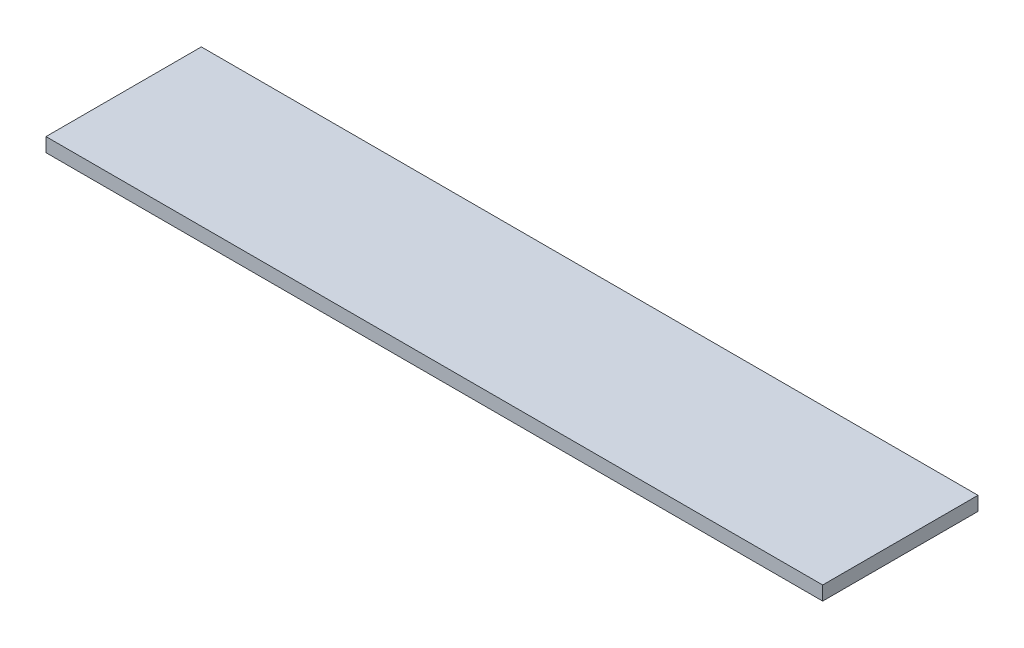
from build123d import *

# Parameters (mm, degrees)
ESQUISSE1_W        = 5000
ESQUISSE1_H        = 90
BOSS_EXTRU_1_DEPTH = 500


with BuildPart() as part:
    # Esquisse1 → Boss.-Extru.1 (new, symmetric)
    with BuildSketch(Plane.XY):
        Rectangle(ESQUISSE1_W, ESQUISSE1_H)
    extrude(amount=BOSS_EXTRU_1_DEPTH, both=True)


solid = part.part
